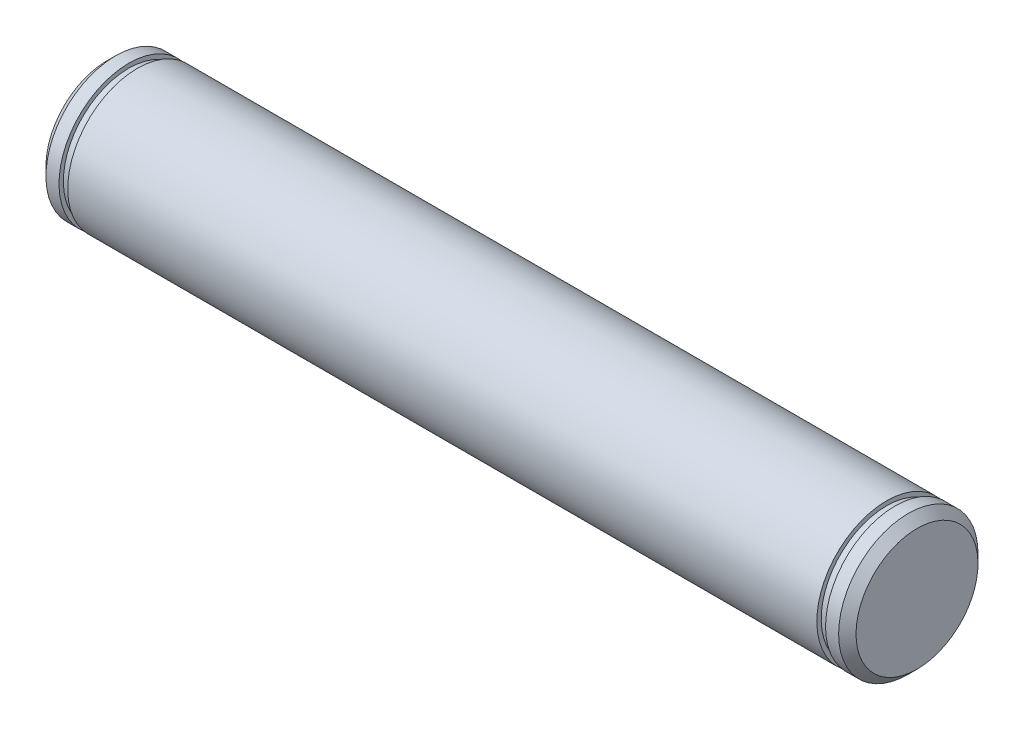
ISO-10303-21;
HEADER;
FILE_DESCRIPTION(('STEP AP214'),'2;1');
FILE_NAME('part.step','',(''),(''),'','','');
FILE_SCHEMA(('AUTOMOTIVE_DESIGN { 1 0 10303 214 1 1 1 1 }'));
ENDSEC;
DATA;
#1=APPLICATION_CONTEXT('core data for automotive mechanical design processes');
#2=APPLICATION_PROTOCOL_DEFINITION('international standard','automotive_design',2000,#1);
#3=PRODUCT_CONTEXT('',#1,'mechanical');
#4=PRODUCT('Part','Part','',(#3));
#5=PRODUCT_RELATED_PRODUCT_CATEGORY('part','',(#4));
#6=PRODUCT_DEFINITION_FORMATION('','',#4);
#7=PRODUCT_DEFINITION_CONTEXT('part definition',#1,'design');
#8=PRODUCT_DEFINITION('design','',#6,#7);
#9=PRODUCT_DEFINITION_SHAPE('','',#8);
#10=(LENGTH_UNIT() NAMED_UNIT(*) SI_UNIT(.MILLI.,.METRE.));
#11=(NAMED_UNIT(*) PLANE_ANGLE_UNIT() SI_UNIT($,.RADIAN.));
#12=(NAMED_UNIT(*) SI_UNIT($,.STERADIAN.) SOLID_ANGLE_UNIT());
#13=UNCERTAINTY_MEASURE_WITH_UNIT(LENGTH_MEASURE(1.E-05),#10,'distance_accuracy_value','');
#14=(GEOMETRIC_REPRESENTATION_CONTEXT(3) GLOBAL_UNCERTAINTY_ASSIGNED_CONTEXT((#13)) GLOBAL_UNIT_ASSIGNED_CONTEXT((#10,
#11,#12)) REPRESENTATION_CONTEXT('',''));
#15=CARTESIAN_POINT('',(0.,0.,0.));
#16=DIRECTION('',(0.,0.,1.));
#17=DIRECTION('',(1.,0.,0.));
#18=AXIS2_PLACEMENT_3D('',#15,#16,#17);
#19=CARTESIAN_POINT('',(-93.,3.99999999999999,0.));
#20=DIRECTION('',(-1.,0.,0.));
#21=DIRECTION('',(0.,-1.,0.));
#22=AXIS2_PLACEMENT_3D('',#19,#20,#21);
#23=PLANE('',#22);
#24=CARTESIAN_POINT('',(-93.,0.,0.));
#25=DIRECTION('',(1.,0.,0.));
#26=DIRECTION('',(0.,0.,-1.));
#27=AXIS2_PLACEMENT_3D('',#24,#25,#26);
#28=CIRCLE('',#27,7.00000000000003);
#29=CARTESIAN_POINT('',(-93.,0.,-7.00000000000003));
#30=VERTEX_POINT('',#29);
#31=EDGE_CURVE('E19',#30,#30,#28,.T.);
#32=ORIENTED_EDGE('',*,*,#31,.F.);
#33=EDGE_LOOP('',(#32));
#34=FACE_BOUND('',#33,.T.);
#35=ADVANCED_FACE('F15',(#34),#23,.T.);
#36=CARTESIAN_POINT('',(0.,4.00000000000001,0.));
#37=DIRECTION('',(1.,0.,0.));
#38=DIRECTION('',(0.,0.,-1.));
#39=AXIS2_PLACEMENT_3D('',#36,#37,#38);
#40=PLANE('',#39);
#41=CARTESIAN_POINT('',(0.,0.,0.));
#42=DIRECTION('',(-1.,0.,0.));
#43=DIRECTION('',(0.,-1.,0.));
#44=AXIS2_PLACEMENT_3D('',#41,#42,#43);
#45=CIRCLE('',#44,7.00000000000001);
#46=CARTESIAN_POINT('',(0.,-7.00000000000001,0.));
#47=VERTEX_POINT('',#46);
#48=EDGE_CURVE('E51',#47,#47,#45,.T.);
#49=ORIENTED_EDGE('',*,*,#48,.F.);
#50=EDGE_LOOP('',(#49));
#51=FACE_BOUND('',#50,.T.);
#52=ADVANCED_FACE('F63',(#51),#40,.T.);
#53=CARTESIAN_POINT('',(-92.,0.,0.));
#54=DIRECTION('',(1.,0.,0.));
#55=DIRECTION('',(0.,0.,-1.));
#56=AXIS2_PLACEMENT_3D('',#53,#54,#55);
#57=CONICAL_SURFACE('',#56,8.00000000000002,0.78539816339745);
#58=ORIENTED_EDGE('',*,*,#31,.T.);
#59=EDGE_LOOP('',(#58));
#60=FACE_BOUND('',#59,.T.);
#61=CARTESIAN_POINT('',(-92.,0.,0.));
#62=DIRECTION('',(1.,0.,0.));
#63=DIRECTION('',(0.,1.,0.));
#64=AXIS2_PLACEMENT_3D('',#61,#62,#63);
#65=CIRCLE('',#64,8.00000000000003);
#66=CARTESIAN_POINT('',(-92.,8.,0.));
#67=VERTEX_POINT('',#66);
#68=EDGE_CURVE('E31',#67,#67,#65,.T.);
#69=ORIENTED_EDGE('',*,*,#68,.F.);
#70=EDGE_LOOP('',(#69));
#71=FACE_BOUND('',#70,.T.);
#72=ADVANCED_FACE('F59',(#60,#71),#57,.T.);
#73=CARTESIAN_POINT('',(-1.,0.,0.));
#74=DIRECTION('',(-1.,0.,0.));
#75=DIRECTION('',(0.,-1.,0.));
#76=AXIS2_PLACEMENT_3D('',#73,#74,#75);
#77=CONICAL_SURFACE('',#76,8.00000000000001,0.785398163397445);
#78=CARTESIAN_POINT('',(-0.999999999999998,0.,0.));
#79=DIRECTION('',(1.,0.,0.));
#80=DIRECTION('',(0.,1.,0.));
#81=AXIS2_PLACEMENT_3D('',#78,#79,#80);
#82=CIRCLE('',#81,8.00000000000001);
#83=CARTESIAN_POINT('',(-1.,8.00000000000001,0.));
#84=VERTEX_POINT('',#83);
#85=EDGE_CURVE('E50',#84,#84,#82,.F.);
#86=ORIENTED_EDGE('',*,*,#85,.F.);
#87=EDGE_LOOP('',(#86));
#88=FACE_BOUND('',#87,.T.);
#89=ORIENTED_EDGE('',*,*,#48,.T.);
#90=EDGE_LOOP('',(#89));
#91=FACE_BOUND('',#90,.T.);
#92=ADVANCED_FACE('F110',(#88,#91),#77,.T.);
#93=CARTESIAN_POINT('',(-91.75,0.,0.));
#94=DIRECTION('',(1.,0.,0.));
#95=DIRECTION('',(0.,1.,0.));
#96=AXIS2_PLACEMENT_3D('',#93,#94,#95);
#97=CYLINDRICAL_SURFACE('',#96,8.00000000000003);
#98=CARTESIAN_POINT('',(-90.5,0.,0.));
#99=DIRECTION('',(1.,0.,0.));
#100=DIRECTION('',(0.,1.,0.));
#101=AXIS2_PLACEMENT_3D('',#98,#99,#100);
#102=CIRCLE('',#101,8.00000000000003);
#103=CARTESIAN_POINT('',(-90.5,8.,0.));
#104=VERTEX_POINT('',#103);
#105=EDGE_CURVE('E48',#104,#104,#102,.T.);
#106=ORIENTED_EDGE('',*,*,#105,.F.);
#107=EDGE_LOOP('',(#106));
#108=FACE_BOUND('',#107,.T.);
#109=ORIENTED_EDGE('',*,*,#68,.T.);
#110=EDGE_LOOP('',(#109));
#111=FACE_BOUND('',#110,.T.);
#112=ADVANCED_FACE('F106',(#108,#111),#97,.T.);
#113=CARTESIAN_POINT('',(-1.25,0.,0.));
#114=DIRECTION('',(1.,0.,0.));
#115=DIRECTION('',(0.,1.,0.));
#116=AXIS2_PLACEMENT_3D('',#113,#114,#115);
#117=CYLINDRICAL_SURFACE('',#116,8.00000000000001);
#118=ORIENTED_EDGE('',*,*,#85,.T.);
#119=EDGE_LOOP('',(#118));
#120=FACE_BOUND('',#119,.T.);
#121=CARTESIAN_POINT('',(-2.5,0.,0.));
#122=DIRECTION('',(1.,0.,0.));
#123=DIRECTION('',(0.,1.,0.));
#124=AXIS2_PLACEMENT_3D('',#121,#122,#123);
#125=CIRCLE('',#124,8.00000000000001);
#126=CARTESIAN_POINT('',(-2.5,8.00000000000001,0.));
#127=VERTEX_POINT('',#126);
#128=EDGE_CURVE('E45',#127,#127,#125,.F.);
#129=ORIENTED_EDGE('',*,*,#128,.F.);
#130=EDGE_LOOP('',(#129));
#131=FACE_BOUND('',#130,.T.);
#132=ADVANCED_FACE('F102',(#120,#131),#117,.T.);
#133=CARTESIAN_POINT('',(-90.5,7.75,0.));
#134=DIRECTION('',(1.,0.,0.));
#135=DIRECTION('',(0.,0.,-1.));
#136=AXIS2_PLACEMENT_3D('',#133,#134,#135);
#137=PLANE('',#136);
#138=ORIENTED_EDGE('',*,*,#105,.T.);
#139=EDGE_LOOP('',(#138));
#140=FACE_BOUND('',#139,.T.);
#141=CARTESIAN_POINT('',(-90.5,0.,0.));
#142=DIRECTION('',(1.,0.,0.));
#143=DIRECTION('',(0.,1.,0.));
#144=AXIS2_PLACEMENT_3D('',#141,#142,#143);
#145=CIRCLE('',#144,7.50000000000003);
#146=CARTESIAN_POINT('',(-90.5,7.5,0.));
#147=VERTEX_POINT('',#146);
#148=EDGE_CURVE('E42',#147,#147,#145,.T.);
#149=ORIENTED_EDGE('',*,*,#148,.F.);
#150=EDGE_LOOP('',(#149));
#151=FACE_BOUND('',#150,.T.);
#152=ADVANCED_FACE('F98',(#140,#151),#137,.T.);
#153=CARTESIAN_POINT('',(-2.50000000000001,7.75,0.));
#154=DIRECTION('',(-1.,0.,0.));
#155=DIRECTION('',(0.,-1.,0.));
#156=AXIS2_PLACEMENT_3D('',#153,#154,#155);
#157=PLANE('',#156);
#158=CARTESIAN_POINT('',(-2.50000000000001,0.,0.));
#159=DIRECTION('',(1.,0.,0.));
#160=DIRECTION('',(0.,1.,0.));
#161=AXIS2_PLACEMENT_3D('',#158,#159,#160);
#162=CIRCLE('',#161,7.5);
#163=CARTESIAN_POINT('',(-2.50000000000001,7.5,0.));
#164=VERTEX_POINT('',#163);
#165=EDGE_CURVE('E39',#164,#164,#162,.F.);
#166=ORIENTED_EDGE('',*,*,#165,.F.);
#167=EDGE_LOOP('',(#166));
#168=FACE_BOUND('',#167,.T.);
#169=ORIENTED_EDGE('',*,*,#128,.T.);
#170=EDGE_LOOP('',(#169));
#171=FACE_BOUND('',#170,.T.);
#172=ADVANCED_FACE('F94',(#168,#171),#157,.T.);
#173=CARTESIAN_POINT('',(-90.,0.,0.));
#174=DIRECTION('',(1.,0.,0.));
#175=DIRECTION('',(0.,1.,0.));
#176=AXIS2_PLACEMENT_3D('',#173,#174,#175);
#177=CYLINDRICAL_SURFACE('',#176,7.50000000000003);
#178=CARTESIAN_POINT('',(-89.5,0.,0.));
#179=DIRECTION('',(1.,0.,0.));
#180=DIRECTION('',(0.,1.,0.));
#181=AXIS2_PLACEMENT_3D('',#178,#179,#180);
#182=CIRCLE('',#181,7.50000000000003);
#183=CARTESIAN_POINT('',(-89.5,7.5,0.));
#184=VERTEX_POINT('',#183);
#185=EDGE_CURVE('E36',#184,#184,#182,.T.);
#186=ORIENTED_EDGE('',*,*,#185,.F.);
#187=EDGE_LOOP('',(#186));
#188=FACE_BOUND('',#187,.T.);
#189=ORIENTED_EDGE('',*,*,#148,.T.);
#190=EDGE_LOOP('',(#189));
#191=FACE_BOUND('',#190,.T.);
#192=ADVANCED_FACE('F88',(#188,#191),#177,.T.);
#193=CARTESIAN_POINT('',(-3.,0.,0.));
#194=DIRECTION('',(1.,0.,0.));
#195=DIRECTION('',(0.,1.,0.));
#196=AXIS2_PLACEMENT_3D('',#193,#194,#195);
#197=CYLINDRICAL_SURFACE('',#196,7.5);
#198=ORIENTED_EDGE('',*,*,#165,.T.);
#199=EDGE_LOOP('',(#198));
#200=FACE_BOUND('',#199,.T.);
#201=CARTESIAN_POINT('',(-3.5,0.,0.));
#202=DIRECTION('',(1.,0.,0.));
#203=DIRECTION('',(0.,1.,0.));
#204=AXIS2_PLACEMENT_3D('',#201,#202,#203);
#205=CIRCLE('',#204,7.5);
#206=CARTESIAN_POINT('',(-3.5,7.5,0.));
#207=VERTEX_POINT('',#206);
#208=EDGE_CURVE('E28',#207,#207,#205,.F.);
#209=ORIENTED_EDGE('',*,*,#208,.F.);
#210=EDGE_LOOP('',(#209));
#211=FACE_BOUND('',#210,.T.);
#212=ADVANCED_FACE('F82',(#200,#211),#197,.T.);
#213=CARTESIAN_POINT('',(-89.5,7.75,0.));
#214=DIRECTION('',(-1.,0.,0.));
#215=DIRECTION('',(0.,-1.,0.));
#216=AXIS2_PLACEMENT_3D('',#213,#214,#215);
#217=PLANE('',#216);
#218=ORIENTED_EDGE('',*,*,#185,.T.);
#219=EDGE_LOOP('',(#218));
#220=FACE_BOUND('',#219,.T.);
#221=CARTESIAN_POINT('',(-89.5,0.,0.));
#222=DIRECTION('',(1.,0.,0.));
#223=DIRECTION('',(0.,1.,0.));
#224=AXIS2_PLACEMENT_3D('',#221,#222,#223);
#225=CIRCLE('',#224,8.00000000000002);
#226=CARTESIAN_POINT('',(-89.5,7.99999999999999,0.));
#227=VERTEX_POINT('',#226);
#228=EDGE_CURVE('E23',#227,#227,#225,.T.);
#229=ORIENTED_EDGE('',*,*,#228,.F.);
#230=EDGE_LOOP('',(#229));
#231=FACE_BOUND('',#230,.T.);
#232=ADVANCED_FACE('F77',(#220,#231),#217,.T.);
#233=CARTESIAN_POINT('',(-3.5,7.75,0.));
#234=DIRECTION('',(1.,0.,0.));
#235=DIRECTION('',(0.,0.,-1.));
#236=AXIS2_PLACEMENT_3D('',#233,#234,#235);
#237=PLANE('',#236);
#238=CARTESIAN_POINT('',(-3.5,0.,0.));
#239=DIRECTION('',(1.,0.,0.));
#240=DIRECTION('',(0.,1.,0.));
#241=AXIS2_PLACEMENT_3D('',#238,#239,#240);
#242=CIRCLE('',#241,8.00000000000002);
#243=CARTESIAN_POINT('',(-3.5,8.00000000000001,0.));
#244=VERTEX_POINT('',#243);
#245=EDGE_CURVE('E10',#244,#244,#242,.F.);
#246=ORIENTED_EDGE('',*,*,#245,.F.);
#247=EDGE_LOOP('',(#246));
#248=FACE_BOUND('',#247,.T.);
#249=ORIENTED_EDGE('',*,*,#208,.T.);
#250=EDGE_LOOP('',(#249));
#251=FACE_BOUND('',#250,.T.);
#252=ADVANCED_FACE('F72',(#248,#251),#237,.T.);
#253=CARTESIAN_POINT('',(-46.5,0.,0.));
#254=DIRECTION('',(1.,0.,0.));
#255=DIRECTION('',(0.,1.,0.));
#256=AXIS2_PLACEMENT_3D('',#253,#254,#255);
#257=CYLINDRICAL_SURFACE('',#256,8.00000000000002);
#258=ORIENTED_EDGE('',*,*,#228,.T.);
#259=EDGE_LOOP('',(#258));
#260=FACE_BOUND('',#259,.T.);
#261=ORIENTED_EDGE('',*,*,#245,.T.);
#262=EDGE_LOOP('',(#261));
#263=FACE_BOUND('',#262,.T.);
#264=ADVANCED_FACE('F17',(#260,#263),#257,.T.);
#265=CLOSED_SHELL('',(#35,#52,#72,#92,#112,#132,#152,#172,#192,#212,#232,#252,#264));
#266=MANIFOLD_SOLID_BREP('B1',#265);
#267=ADVANCED_BREP_SHAPE_REPRESENTATION('',(#18,#266),#14);
#268=SHAPE_DEFINITION_REPRESENTATION(#9,#267);
ENDSEC;
END-ISO-10303-21;
